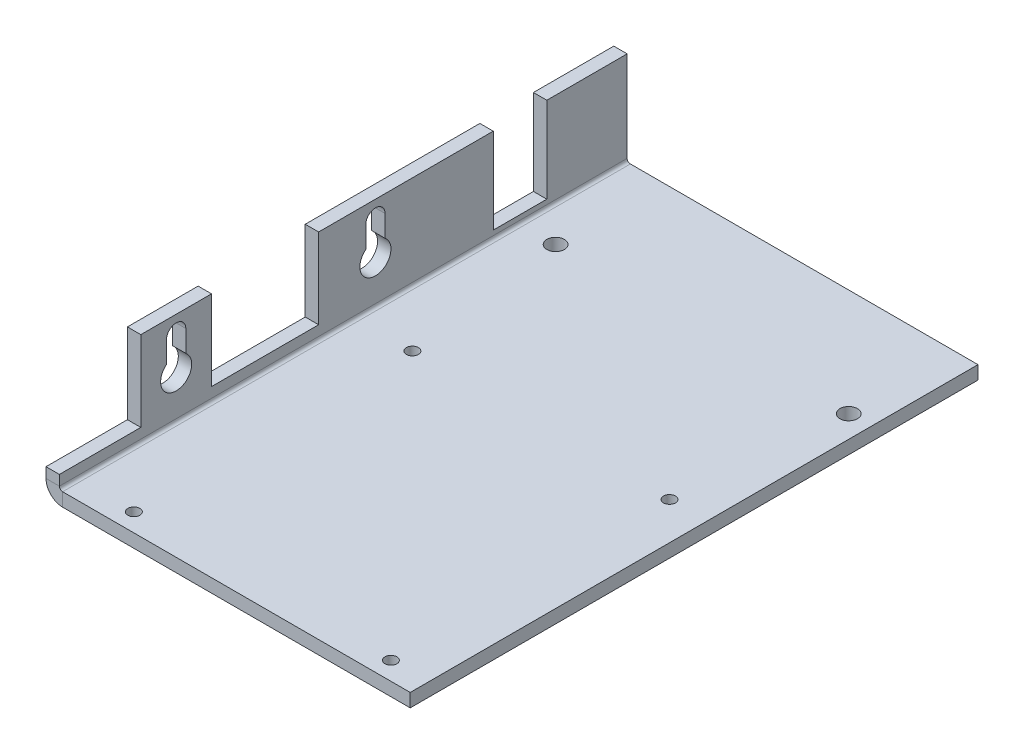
ISO-10303-21;
HEADER;
FILE_DESCRIPTION(('STEP AP214'),'2;1');
FILE_NAME('part.step','',(''),(''),'','','');
FILE_SCHEMA(('AUTOMOTIVE_DESIGN { 1 0 10303 214 1 1 1 1 }'));
ENDSEC;
DATA;
#1=APPLICATION_CONTEXT('core data for automotive mechanical design processes');
#2=APPLICATION_PROTOCOL_DEFINITION('international standard','automotive_design',2000,#1);
#3=PRODUCT_CONTEXT('',#1,'mechanical');
#4=PRODUCT('Part','Part','',(#3));
#5=PRODUCT_RELATED_PRODUCT_CATEGORY('part','',(#4));
#6=PRODUCT_DEFINITION_FORMATION('','',#4);
#7=PRODUCT_DEFINITION_CONTEXT('part definition',#1,'design');
#8=PRODUCT_DEFINITION('design','',#6,#7);
#9=PRODUCT_DEFINITION_SHAPE('','',#8);
#10=(LENGTH_UNIT() NAMED_UNIT(*) SI_UNIT(.MILLI.,.METRE.));
#11=(NAMED_UNIT(*) PLANE_ANGLE_UNIT() SI_UNIT($,.RADIAN.));
#12=(NAMED_UNIT(*) SI_UNIT($,.STERADIAN.) SOLID_ANGLE_UNIT());
#13=UNCERTAINTY_MEASURE_WITH_UNIT(LENGTH_MEASURE(1.E-05),#10,'distance_accuracy_value','');
#14=(GEOMETRIC_REPRESENTATION_CONTEXT(3) GLOBAL_UNCERTAINTY_ASSIGNED_CONTEXT((#13)) GLOBAL_UNIT_ASSIGNED_CONTEXT((#10,
#11,#12)) REPRESENTATION_CONTEXT('',''));
#15=CARTESIAN_POINT('',(0.,0.,0.));
#16=DIRECTION('',(0.,0.,1.));
#17=DIRECTION('',(1.,0.,0.));
#18=AXIS2_PLACEMENT_3D('',#15,#16,#17);
#19=CARTESIAN_POINT('',(-43.18,21.336,-29.972));
#20=DIRECTION('',(0.,0.,-1.));
#21=DIRECTION('',(-1.,0.,0.));
#22=AXIS2_PLACEMENT_3D('',#19,#20,#21);
#23=PLANE('',#22);
#24=DIRECTION('',(0.,1.,0.));
#25=VECTOR('',#24,1.);
#26=CARTESIAN_POINT('',(-40.005,21.336,-29.972));
#27=LINE('',#26,#25);
#28=CARTESIAN_POINT('',(-40.005,16.2226795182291,-29.972));
#29=VERTEX_POINT('',#28);
#30=CARTESIAN_POINT('',(-40.005,21.336,-29.972));
#31=VERTEX_POINT('',#30);
#32=EDGE_CURVE('E340',#29,#31,#27,.T.);
#33=ORIENTED_EDGE('',*,*,#32,.T.);
#34=DIRECTION('',(1.,0.,0.));
#35=VECTOR('',#34,1.);
#36=CARTESIAN_POINT('',(-43.18,21.336,-29.972));
#37=LINE('',#36,#35);
#38=CARTESIAN_POINT('',(-43.18,21.336,-29.972));
#39=VERTEX_POINT('',#38);
#40=EDGE_CURVE('E405',#39,#31,#37,.T.);
#41=ORIENTED_EDGE('',*,*,#40,.F.);
#42=DIRECTION('',(0.,1.,0.));
#43=VECTOR('',#42,1.);
#44=CARTESIAN_POINT('',(-43.18,21.336,-29.972));
#45=LINE('',#44,#43);
#46=CARTESIAN_POINT('',(-43.18,16.2226795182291,-29.972));
#47=VERTEX_POINT('',#46);
#48=EDGE_CURVE('E399',#47,#39,#45,.T.);
#49=ORIENTED_EDGE('',*,*,#48,.F.);
#50=DIRECTION('',(1.,0.,0.));
#51=VECTOR('',#50,1.);
#52=CARTESIAN_POINT('',(-43.18,16.2226795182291,-29.972));
#53=LINE('',#52,#51);
#54=EDGE_CURVE('E411',#47,#29,#53,.T.);
#55=ORIENTED_EDGE('',*,*,#54,.T.);
#56=EDGE_LOOP('',(#33,#41,#49,#55));
#57=FACE_BOUND('',#56,.T.);
#58=ADVANCED_FACE('F32',(#57),#23,.F.);
#59=CARTESIAN_POINT('',(-43.18,13.335,-27.6860000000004));
#60=DIRECTION('',(1.,0.,0.));
#61=DIRECTION('',(0.,0.,-1.));
#62=AXIS2_PLACEMENT_3D('',#59,#60,#61);
#63=CYLINDRICAL_SURFACE('',#62,3.683);
#64=CARTESIAN_POINT('',(-40.005,13.335,-27.6860000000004));
#65=DIRECTION('',(1.,0.,0.));
#66=DIRECTION('',(0.,0.,-1.));
#67=AXIS2_PLACEMENT_3D('',#64,#65,#66);
#68=CIRCLE('',#67,3.683);
#69=CARTESIAN_POINT('',(-40.005,16.2226795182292,-25.4));
#70=VERTEX_POINT('',#69);
#71=EDGE_CURVE('E343',#70,#29,#68,.T.);
#72=ORIENTED_EDGE('',*,*,#71,.T.);
#73=ORIENTED_EDGE('',*,*,#54,.F.);
#74=CARTESIAN_POINT('',(-43.18,13.335,-27.6860000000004));
#75=DIRECTION('',(1.,0.,0.));
#76=DIRECTION('',(0.,0.,-1.));
#77=AXIS2_PLACEMENT_3D('',#74,#75,#76);
#78=CIRCLE('',#77,3.683);
#79=CARTESIAN_POINT('',(-43.18,16.2226795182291,-25.4));
#80=VERTEX_POINT('',#79);
#81=EDGE_CURVE('E397',#80,#47,#78,.T.);
#82=ORIENTED_EDGE('',*,*,#81,.F.);
#83=DIRECTION('',(1.,0.,0.));
#84=VECTOR('',#83,1.);
#85=CARTESIAN_POINT('',(-43.18,16.2226795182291,-25.4));
#86=LINE('',#85,#84);
#87=EDGE_CURVE('E408',#80,#70,#86,.T.);
#88=ORIENTED_EDGE('',*,*,#87,.T.);
#89=EDGE_LOOP('',(#72,#73,#82,#88));
#90=FACE_BOUND('',#89,.T.);
#91=ADVANCED_FACE('F567',(#90),#63,.F.);
#92=CARTESIAN_POINT('',(-43.18,21.336,-25.4));
#93=DIRECTION('',(0.,0.,1.));
#94=DIRECTION('',(0.,-1.,0.));
#95=AXIS2_PLACEMENT_3D('',#92,#93,#94);
#96=PLANE('',#95);
#97=DIRECTION('',(0.,-1.,0.));
#98=VECTOR('',#97,1.);
#99=CARTESIAN_POINT('',(-40.005,21.336,-25.4));
#100=LINE('',#99,#98);
#101=CARTESIAN_POINT('',(-40.005,21.336,-25.4));
#102=VERTEX_POINT('',#101);
#103=EDGE_CURVE('E335',#102,#70,#100,.T.);
#104=ORIENTED_EDGE('',*,*,#103,.T.);
#105=ORIENTED_EDGE('',*,*,#87,.F.);
#106=DIRECTION('',(0.,-1.,0.));
#107=VECTOR('',#106,1.);
#108=CARTESIAN_POINT('',(-43.18,21.336,-25.4));
#109=LINE('',#108,#107);
#110=CARTESIAN_POINT('',(-43.18,21.336,-25.4));
#111=VERTEX_POINT('',#110);
#112=EDGE_CURVE('E395',#111,#80,#109,.T.);
#113=ORIENTED_EDGE('',*,*,#112,.F.);
#114=DIRECTION('',(1.,0.,0.));
#115=VECTOR('',#114,1.);
#116=CARTESIAN_POINT('',(-43.18,21.336,-25.4));
#117=LINE('',#116,#115);
#118=EDGE_CURVE('E402',#111,#102,#117,.T.);
#119=ORIENTED_EDGE('',*,*,#118,.T.);
#120=EDGE_LOOP('',(#104,#105,#113,#119));
#121=FACE_BOUND('',#120,.T.);
#122=ADVANCED_FACE('F563',(#121),#96,.F.);
#123=CARTESIAN_POINT('',(-43.18,21.336,-27.686));
#124=DIRECTION('',(1.,0.,0.));
#125=DIRECTION('',(0.,0.,-1.));
#126=AXIS2_PLACEMENT_3D('',#123,#124,#125);
#127=CYLINDRICAL_SURFACE('',#126,2.286);
#128=CARTESIAN_POINT('',(-40.005,21.336,-27.686));
#129=DIRECTION('',(1.,0.,0.));
#130=DIRECTION('',(0.,0.,-1.));
#131=AXIS2_PLACEMENT_3D('',#128,#129,#130);
#132=CIRCLE('',#131,2.286);
#133=EDGE_CURVE('E337',#31,#102,#132,.T.);
#134=ORIENTED_EDGE('',*,*,#133,.T.);
#135=ORIENTED_EDGE('',*,*,#118,.F.);
#136=CARTESIAN_POINT('',(-43.18,21.336,-27.686));
#137=DIRECTION('',(1.,0.,0.));
#138=DIRECTION('',(0.,0.,-1.));
#139=AXIS2_PLACEMENT_3D('',#136,#137,#138);
#140=CIRCLE('',#139,2.286);
#141=EDGE_CURVE('E393',#39,#111,#140,.T.);
#142=ORIENTED_EDGE('',*,*,#141,.F.);
#143=ORIENTED_EDGE('',*,*,#40,.T.);
#144=EDGE_LOOP('',(#134,#135,#142,#143));
#145=FACE_BOUND('',#144,.T.);
#146=ADVANCED_FACE('F560',(#145),#127,.F.);
#147=CARTESIAN_POINT('',(-43.18,0.,-134.62));
#148=DIRECTION('',(-1.,0.,0.));
#149=DIRECTION('',(0.,0.,1.));
#150=AXIS2_PLACEMENT_3D('',#147,#148,#149);
#151=PLANE('',#150);
#152=DIRECTION('',(0.,0.,-1.));
#153=VECTOR('',#152,1.);
#154=CARTESIAN_POINT('',(-43.18,3.937,-134.62));
#155=LINE('',#154,#153);
#156=CARTESIAN_POINT('',(-43.18,3.937,0.));
#157=VERTEX_POINT('',#156);
#158=CARTESIAN_POINT('',(-43.18,3.93699999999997,-134.62));
#159=VERTEX_POINT('',#158);
#160=EDGE_CURVE('E416',#157,#159,#155,.T.);
#161=ORIENTED_EDGE('',*,*,#160,.F.);
#162=DIRECTION('',(0.,-1.,0.));
#163=VECTOR('',#162,1.);
#164=CARTESIAN_POINT('',(-43.18,0.,0.));
#165=LINE('',#164,#163);
#166=CARTESIAN_POINT('',(-43.18,6.35000000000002,0.));
#167=VERTEX_POINT('',#166);
#168=EDGE_CURVE('E388',#167,#157,#165,.T.);
#169=ORIENTED_EDGE('',*,*,#168,.F.);
#170=DIRECTION('',(0.,0.,1.));
#171=VECTOR('',#170,1.);
#172=CARTESIAN_POINT('',(-43.18,6.35000000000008,-19.304));
#173=LINE('',#172,#171);
#174=CARTESIAN_POINT('',(-43.18,6.35000000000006,-19.304));
#175=VERTEX_POINT('',#174);
#176=EDGE_CURVE('E390',#175,#167,#173,.T.);
#177=ORIENTED_EDGE('',*,*,#176,.F.);
#178=DIRECTION('',(0.,-1.,0.));
#179=VECTOR('',#178,1.);
#180=CARTESIAN_POINT('',(-43.18,44.4499999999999,-19.3040000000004));
#181=LINE('',#180,#179);
#182=CARTESIAN_POINT('',(-43.18,25.4,-19.304));
#183=VERTEX_POINT('',#182);
#184=EDGE_CURVE('E370',#183,#175,#181,.T.);
#185=ORIENTED_EDGE('',*,*,#184,.F.);
#186=DIRECTION('',(0.,0.,1.));
#187=VECTOR('',#186,1.);
#188=CARTESIAN_POINT('',(-43.18,25.4,-134.62));
#189=LINE('',#188,#187);
#190=CARTESIAN_POINT('',(-43.18,25.4,-36.068));
#191=VERTEX_POINT('',#190);
#192=EDGE_CURVE('E372',#191,#183,#189,.T.);
#193=ORIENTED_EDGE('',*,*,#192,.F.);
#194=DIRECTION('',(0.,1.,0.));
#195=VECTOR('',#194,1.);
#196=CARTESIAN_POINT('',(-43.18,44.4499999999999,-36.0680000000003));
#197=LINE('',#196,#195);
#198=CARTESIAN_POINT('',(-43.18,6.34999999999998,-36.068));
#199=VERTEX_POINT('',#198);
#200=EDGE_CURVE('E374',#199,#191,#197,.T.);
#201=ORIENTED_EDGE('',*,*,#200,.F.);
#202=DIRECTION('',(0.,0.,1.));
#203=VECTOR('',#202,1.);
#204=CARTESIAN_POINT('',(-43.18,6.34999999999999,-61.468));
#205=LINE('',#204,#203);
#206=CARTESIAN_POINT('',(-43.18,6.34999999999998,-61.468));
#207=VERTEX_POINT('',#206);
#208=EDGE_CURVE('E377',#207,#199,#205,.T.);
#209=ORIENTED_EDGE('',*,*,#208,.F.);
#210=DIRECTION('',(0.,-1.,0.));
#211=VECTOR('',#210,1.);
#212=CARTESIAN_POINT('',(-43.18,44.45,-61.4680000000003));
#213=LINE('',#212,#211);
#214=CARTESIAN_POINT('',(-43.18,25.4,-61.468));
#215=VERTEX_POINT('',#214);
#216=EDGE_CURVE('E379',#215,#207,#213,.T.);
#217=ORIENTED_EDGE('',*,*,#216,.F.);
#218=CARTESIAN_POINT('',(-43.18,25.4,-102.87));
#219=VERTEX_POINT('',#218);
#220=EDGE_CURVE('E375',#219,#215,#189,.T.);
#221=ORIENTED_EDGE('',*,*,#220,.F.);
#222=DIRECTION('',(0.,1.,0.));
#223=VECTOR('',#222,1.);
#224=CARTESIAN_POINT('',(-43.18,45.72,-102.87));
#225=LINE('',#224,#223);
#226=CARTESIAN_POINT('',(-43.18,5.07999999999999,-102.87));
#227=VERTEX_POINT('',#226);
#228=EDGE_CURVE('E381',#227,#219,#225,.T.);
#229=ORIENTED_EDGE('',*,*,#228,.F.);
#230=DIRECTION('',(0.,0.,1.));
#231=VECTOR('',#230,1.);
#232=CARTESIAN_POINT('',(-43.18,5.08000000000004,-115.57));
#233=LINE('',#232,#231);
#234=CARTESIAN_POINT('',(-43.18,5.08000000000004,-115.57));
#235=VERTEX_POINT('',#234);
#236=EDGE_CURVE('E383',#235,#227,#233,.T.);
#237=ORIENTED_EDGE('',*,*,#236,.F.);
#238=DIRECTION('',(0.,-1.,0.));
#239=VECTOR('',#238,1.);
#240=CARTESIAN_POINT('',(-43.18,45.72,-115.57));
#241=LINE('',#240,#239);
#242=CARTESIAN_POINT('',(-43.18,25.4,-115.57));
#243=VERTEX_POINT('',#242);
#244=EDGE_CURVE('E385',#243,#235,#241,.T.);
#245=ORIENTED_EDGE('',*,*,#244,.F.);
#246=CARTESIAN_POINT('',(-43.18,25.4,-134.62));
#247=VERTEX_POINT('',#246);
#248=EDGE_CURVE('E53',#247,#243,#189,.T.);
#249=ORIENTED_EDGE('',*,*,#248,.F.);
#250=DIRECTION('',(0.,-1.,0.));
#251=VECTOR('',#250,1.);
#252=CARTESIAN_POINT('',(-43.18,0.,-134.62));
#253=LINE('',#252,#251);
#254=EDGE_CURVE('E46',#247,#159,#253,.T.);
#255=ORIENTED_EDGE('',*,*,#254,.T.);
#256=EDGE_LOOP('',(#161,#169,#177,#185,#193,#201,#209,#217,#221,#229,#237,#245,#249,#255));
#257=FACE_BOUND('',#256,.T.);
#258=CARTESIAN_POINT('',(-43.18,13.335,-74.9300000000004));
#259=DIRECTION('',(1.,0.,0.));
#260=DIRECTION('',(0.,0.,1.));
#261=AXIS2_PLACEMENT_3D('',#258,#259,#260);
#262=CIRCLE('',#261,3.683);
#263=CARTESIAN_POINT('',(-43.18,16.2226795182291,-72.6439999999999));
#264=VERTEX_POINT('',#263);
#265=CARTESIAN_POINT('',(-43.18,16.2226795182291,-77.216));
#266=VERTEX_POINT('',#265);
#267=EDGE_CURVE('E367',#264,#266,#262,.T.);
#268=ORIENTED_EDGE('',*,*,#267,.T.);
#269=DIRECTION('',(0.,1.,0.));
#270=VECTOR('',#269,1.);
#271=CARTESIAN_POINT('',(-43.18,21.336,-77.216));
#272=LINE('',#271,#270);
#273=CARTESIAN_POINT('',(-43.18,21.336,-77.216));
#274=VERTEX_POINT('',#273);
#275=EDGE_CURVE('E349',#266,#274,#272,.T.);
#276=ORIENTED_EDGE('',*,*,#275,.T.);
#277=CARTESIAN_POINT('',(-43.18,21.336,-74.9299999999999));
#278=DIRECTION('',(1.,0.,0.));
#279=DIRECTION('',(0.,0.,1.));
#280=AXIS2_PLACEMENT_3D('',#277,#278,#279);
#281=CIRCLE('',#280,2.286);
#282=CARTESIAN_POINT('',(-43.18,21.336,-72.644));
#283=VERTEX_POINT('',#282);
#284=EDGE_CURVE('E358',#274,#283,#281,.T.);
#285=ORIENTED_EDGE('',*,*,#284,.T.);
#286=DIRECTION('',(0.,-1.,0.));
#287=VECTOR('',#286,1.);
#288=CARTESIAN_POINT('',(-43.18,21.336,-72.644));
#289=LINE('',#288,#287);
#290=EDGE_CURVE('E364',#283,#264,#289,.T.);
#291=ORIENTED_EDGE('',*,*,#290,.T.);
#292=EDGE_LOOP('',(#268,#276,#285,#291));
#293=FACE_BOUND('',#292,.T.);
#294=ORIENTED_EDGE('',*,*,#141,.T.);
#295=ORIENTED_EDGE('',*,*,#112,.T.);
#296=ORIENTED_EDGE('',*,*,#81,.T.);
#297=ORIENTED_EDGE('',*,*,#48,.T.);
#298=EDGE_LOOP('',(#294,#295,#296,#297));
#299=FACE_BOUND('',#298,.T.);
#300=ADVANCED_FACE('F457',(#257,#293,#299),#151,.T.);
#301=CARTESIAN_POINT('',(-43.18,13.335,-74.9300000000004));
#302=DIRECTION('',(1.,0.,0.));
#303=DIRECTION('',(0.,0.,-1.));
#304=AXIS2_PLACEMENT_3D('',#301,#302,#303);
#305=CYLINDRICAL_SURFACE('',#304,3.683);
#306=CARTESIAN_POINT('',(-40.005,13.335,-74.9300000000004));
#307=DIRECTION('',(1.,0.,0.));
#308=DIRECTION('',(0.,0.,1.));
#309=AXIS2_PLACEMENT_3D('',#306,#307,#308);
#310=CIRCLE('',#309,3.683);
#311=CARTESIAN_POINT('',(-40.005,16.2226795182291,-72.6439999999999));
#312=VERTEX_POINT('',#311);
#313=CARTESIAN_POINT('',(-40.005,16.2226795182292,-77.216));
#314=VERTEX_POINT('',#313);
#315=EDGE_CURVE('E326',#312,#314,#310,.T.);
#316=ORIENTED_EDGE('',*,*,#315,.T.);
#317=DIRECTION('',(1.,0.,0.));
#318=VECTOR('',#317,1.);
#319=CARTESIAN_POINT('',(-43.18,16.2226795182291,-77.216));
#320=LINE('',#319,#318);
#321=EDGE_CURVE('E352',#266,#314,#320,.T.);
#322=ORIENTED_EDGE('',*,*,#321,.F.);
#323=ORIENTED_EDGE('',*,*,#267,.F.);
#324=DIRECTION('',(1.,0.,0.));
#325=VECTOR('',#324,1.);
#326=CARTESIAN_POINT('',(-43.18,16.2226795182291,-72.6439999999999));
#327=LINE('',#326,#325);
#328=EDGE_CURVE('E361',#264,#312,#327,.T.);
#329=ORIENTED_EDGE('',*,*,#328,.T.);
#330=EDGE_LOOP('',(#316,#322,#323,#329));
#331=FACE_BOUND('',#330,.T.);
#332=ADVANCED_FACE('F553',(#331),#305,.F.);
#333=CARTESIAN_POINT('',(-43.18,21.336,-72.644));
#334=DIRECTION('',(0.,0.,1.));
#335=DIRECTION('',(1.,0.,0.));
#336=AXIS2_PLACEMENT_3D('',#333,#334,#335);
#337=PLANE('',#336);
#338=DIRECTION('',(0.,-1.,0.));
#339=VECTOR('',#338,1.);
#340=CARTESIAN_POINT('',(-40.005,21.336,-72.644));
#341=LINE('',#340,#339);
#342=CARTESIAN_POINT('',(-40.005,21.336,-72.644));
#343=VERTEX_POINT('',#342);
#344=EDGE_CURVE('E329',#343,#312,#341,.T.);
#345=ORIENTED_EDGE('',*,*,#344,.T.);
#346=ORIENTED_EDGE('',*,*,#328,.F.);
#347=ORIENTED_EDGE('',*,*,#290,.F.);
#348=DIRECTION('',(1.,0.,0.));
#349=VECTOR('',#348,1.);
#350=CARTESIAN_POINT('',(-43.18,21.336,-72.644));
#351=LINE('',#350,#349);
#352=EDGE_CURVE('E355',#283,#343,#351,.T.);
#353=ORIENTED_EDGE('',*,*,#352,.T.);
#354=EDGE_LOOP('',(#345,#346,#347,#353));
#355=FACE_BOUND('',#354,.T.);
#356=ADVANCED_FACE('F549',(#355),#337,.F.);
#357=CARTESIAN_POINT('',(-43.18,21.336,-74.9299999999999));
#358=DIRECTION('',(1.,0.,0.));
#359=DIRECTION('',(0.,0.,-1.));
#360=AXIS2_PLACEMENT_3D('',#357,#358,#359);
#361=CYLINDRICAL_SURFACE('',#360,2.286);
#362=CARTESIAN_POINT('',(-40.005,21.336,-74.9299999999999));
#363=DIRECTION('',(1.,0.,0.));
#364=DIRECTION('',(0.,0.,1.));
#365=AXIS2_PLACEMENT_3D('',#362,#363,#364);
#366=CIRCLE('',#365,2.286);
#367=CARTESIAN_POINT('',(-40.005,21.3360000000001,-77.216));
#368=VERTEX_POINT('',#367);
#369=EDGE_CURVE('E332',#368,#343,#366,.T.);
#370=ORIENTED_EDGE('',*,*,#369,.T.);
#371=ORIENTED_EDGE('',*,*,#352,.F.);
#372=ORIENTED_EDGE('',*,*,#284,.F.);
#373=DIRECTION('',(1.,0.,0.));
#374=VECTOR('',#373,1.);
#375=CARTESIAN_POINT('',(-43.18,21.336,-77.216));
#376=LINE('',#375,#374);
#377=EDGE_CURVE('E346',#274,#368,#376,.T.);
#378=ORIENTED_EDGE('',*,*,#377,.T.);
#379=EDGE_LOOP('',(#370,#371,#372,#378));
#380=FACE_BOUND('',#379,.T.);
#381=ADVANCED_FACE('F541',(#380),#361,.F.);
#382=CARTESIAN_POINT('',(-43.18,21.336,-77.216));
#383=DIRECTION('',(0.,0.,-1.));
#384=DIRECTION('',(0.,1.,0.));
#385=AXIS2_PLACEMENT_3D('',#382,#383,#384);
#386=PLANE('',#385);
#387=DIRECTION('',(0.,1.,0.));
#388=VECTOR('',#387,1.);
#389=CARTESIAN_POINT('',(-40.005,21.3360000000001,-77.216));
#390=LINE('',#389,#388);
#391=EDGE_CURVE('E324',#314,#368,#390,.T.);
#392=ORIENTED_EDGE('',*,*,#391,.T.);
#393=ORIENTED_EDGE('',*,*,#377,.F.);
#394=ORIENTED_EDGE('',*,*,#275,.F.);
#395=ORIENTED_EDGE('',*,*,#321,.T.);
#396=EDGE_LOOP('',(#392,#393,#394,#395));
#397=FACE_BOUND('',#396,.T.);
#398=ADVANCED_FACE('F535',(#397),#386,.F.);
#399=CARTESIAN_POINT('',(-40.005,0.,-134.62));
#400=DIRECTION('',(-1.,0.,0.));
#401=DIRECTION('',(0.,0.,1.));
#402=AXIS2_PLACEMENT_3D('',#399,#400,#401);
#403=PLANE('',#402);
#404=DIRECTION('',(0.,1.,0.));
#405=VECTOR('',#404,1.);
#406=CARTESIAN_POINT('',(-40.005,0.,0.));
#407=LINE('',#406,#405);
#408=CARTESIAN_POINT('',(-40.005,6.35000000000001,0.));
#409=VERTEX_POINT('',#408);
#410=CARTESIAN_POINT('',(-40.005,3.937,0.));
#411=VERTEX_POINT('',#410);
#412=EDGE_CURVE('E307',#409,#411,#407,.F.);
#413=ORIENTED_EDGE('',*,*,#412,.T.);
#414=DIRECTION('',(0.,0.,-1.));
#415=VECTOR('',#414,1.);
#416=CARTESIAN_POINT('',(-40.005,3.93700000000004,-134.62));
#417=LINE('',#416,#415);
#418=CARTESIAN_POINT('',(-40.005,3.93700000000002,-134.62));
#419=VERTEX_POINT('',#418);
#420=EDGE_CURVE('E414',#411,#419,#417,.T.);
#421=ORIENTED_EDGE('',*,*,#420,.T.);
#422=DIRECTION('',(0.,1.,0.));
#423=VECTOR('',#422,1.);
#424=CARTESIAN_POINT('',(-40.005,0.,-134.62));
#425=LINE('',#424,#423);
#426=CARTESIAN_POINT('',(-40.005,25.4,-134.62));
#427=VERTEX_POINT('',#426);
#428=EDGE_CURVE('E309',#427,#419,#425,.F.);
#429=ORIENTED_EDGE('',*,*,#428,.F.);
#430=DIRECTION('',(0.,0.,1.));
#431=VECTOR('',#430,1.);
#432=CARTESIAN_POINT('',(-40.005,25.4,-134.62));
#433=LINE('',#432,#431);
#434=CARTESIAN_POINT('',(-40.005,25.4,-115.57));
#435=VERTEX_POINT('',#434);
#436=EDGE_CURVE('E247',#427,#435,#433,.T.);
#437=ORIENTED_EDGE('',*,*,#436,.T.);
#438=DIRECTION('',(0.,-1.,0.));
#439=VECTOR('',#438,1.);
#440=CARTESIAN_POINT('',(-40.005,0.,-115.57));
#441=LINE('',#440,#439);
#442=CARTESIAN_POINT('',(-40.005,5.08,-115.57));
#443=VERTEX_POINT('',#442);
#444=EDGE_CURVE('E312',#435,#443,#441,.T.);
#445=ORIENTED_EDGE('',*,*,#444,.T.);
#446=DIRECTION('',(0.,0.,1.));
#447=VECTOR('',#446,1.);
#448=CARTESIAN_POINT('',(-40.005,5.08000000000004,-134.62));
#449=LINE('',#448,#447);
#450=CARTESIAN_POINT('',(-40.005,5.08,-102.87));
#451=VERTEX_POINT('',#450);
#452=EDGE_CURVE('E314',#443,#451,#449,.T.);
#453=ORIENTED_EDGE('',*,*,#452,.T.);
#454=DIRECTION('',(0.,1.,0.));
#455=VECTOR('',#454,1.);
#456=CARTESIAN_POINT('',(-40.005,0.,-102.87));
#457=LINE('',#456,#455);
#458=CARTESIAN_POINT('',(-40.005,25.4,-102.87));
#459=VERTEX_POINT('',#458);
#460=EDGE_CURVE('E316',#451,#459,#457,.T.);
#461=ORIENTED_EDGE('',*,*,#460,.T.);
#462=CARTESIAN_POINT('',(-40.005,25.4,-61.468));
#463=VERTEX_POINT('',#462);
#464=EDGE_CURVE('E246',#459,#463,#433,.T.);
#465=ORIENTED_EDGE('',*,*,#464,.T.);
#466=DIRECTION('',(0.,-1.,0.));
#467=VECTOR('',#466,1.);
#468=CARTESIAN_POINT('',(-40.005,0.,-61.468));
#469=LINE('',#468,#467);
#470=CARTESIAN_POINT('',(-40.005,6.35000000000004,-61.468));
#471=VERTEX_POINT('',#470);
#472=EDGE_CURVE('E318',#463,#471,#469,.T.);
#473=ORIENTED_EDGE('',*,*,#472,.T.);
#474=DIRECTION('',(0.,0.,1.));
#475=VECTOR('',#474,1.);
#476=CARTESIAN_POINT('',(-40.005,6.35000000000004,-134.62));
#477=LINE('',#476,#475);
#478=CARTESIAN_POINT('',(-40.005,6.34999999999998,-36.068));
#479=VERTEX_POINT('',#478);
#480=EDGE_CURVE('E320',#471,#479,#477,.T.);
#481=ORIENTED_EDGE('',*,*,#480,.T.);
#482=DIRECTION('',(0.,1.,0.));
#483=VECTOR('',#482,1.);
#484=CARTESIAN_POINT('',(-40.005,0.,-36.068));
#485=LINE('',#484,#483);
#486=CARTESIAN_POINT('',(-40.005,25.4,-36.068));
#487=VERTEX_POINT('',#486);
#488=EDGE_CURVE('E322',#479,#487,#485,.T.);
#489=ORIENTED_EDGE('',*,*,#488,.T.);
#490=CARTESIAN_POINT('',(-40.005,25.4,-19.304));
#491=VERTEX_POINT('',#490);
#492=EDGE_CURVE('E241',#487,#491,#433,.T.);
#493=ORIENTED_EDGE('',*,*,#492,.T.);
#494=DIRECTION('',(0.,-1.,0.));
#495=VECTOR('',#494,1.);
#496=CARTESIAN_POINT('',(-40.005,0.,-19.304));
#497=LINE('',#496,#495);
#498=CARTESIAN_POINT('',(-40.005,6.35000000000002,-19.304));
#499=VERTEX_POINT('',#498);
#500=EDGE_CURVE('E244',#491,#499,#497,.T.);
#501=ORIENTED_EDGE('',*,*,#500,.T.);
#502=DIRECTION('',(0.,0.,1.));
#503=VECTOR('',#502,1.);
#504=CARTESIAN_POINT('',(-40.005,6.35000000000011,-134.62));
#505=LINE('',#504,#503);
#506=EDGE_CURVE('E305',#499,#409,#505,.T.);
#507=ORIENTED_EDGE('',*,*,#506,.T.);
#508=EDGE_LOOP('',(#413,#421,#429,#437,#445,#453,#461,#465,#473,#481,#489,#493,#501,#507));
#509=FACE_BOUND('',#508,.T.);
#510=ORIENTED_EDGE('',*,*,#391,.F.);
#511=ORIENTED_EDGE('',*,*,#315,.F.);
#512=ORIENTED_EDGE('',*,*,#344,.F.);
#513=ORIENTED_EDGE('',*,*,#369,.F.);
#514=EDGE_LOOP('',(#510,#511,#512,#513));
#515=FACE_BOUND('',#514,.T.);
#516=ORIENTED_EDGE('',*,*,#103,.F.);
#517=ORIENTED_EDGE('',*,*,#133,.F.);
#518=ORIENTED_EDGE('',*,*,#32,.F.);
#519=ORIENTED_EDGE('',*,*,#71,.F.);
#520=EDGE_LOOP('',(#516,#517,#518,#519));
#521=FACE_BOUND('',#520,.T.);
#522=ADVANCED_FACE('F485',(#509,#515,#521),#403,.F.);
#523=CARTESIAN_POINT('',(232.635457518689,0.,-134.62));
#524=DIRECTION('',(0.,0.,-1.));
#525=DIRECTION('',(0.,1.,0.));
#526=AXIS2_PLACEMENT_3D('',#523,#524,#525);
#527=PLANE('',#526);
#528=DIRECTION('',(-1.,0.,0.));
#529=VECTOR('',#528,1.);
#530=CARTESIAN_POINT('',(232.635457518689,3.937,-134.62));
#531=LINE('',#530,#529);
#532=EDGE_CURVE('E11',#419,#159,#531,.T.);
#533=ORIENTED_EDGE('',*,*,#532,.T.);
#534=ORIENTED_EDGE('',*,*,#254,.F.);
#535=DIRECTION('',(-1.,0.,0.));
#536=VECTOR('',#535,1.);
#537=CARTESIAN_POINT('',(232.635457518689,25.4,-134.62));
#538=LINE('',#537,#536);
#539=EDGE_CURVE('E40',#427,#247,#538,.T.);
#540=ORIENTED_EDGE('',*,*,#539,.F.);
#541=ORIENTED_EDGE('',*,*,#428,.T.);
#542=EDGE_LOOP('',(#533,#534,#540,#541));
#543=FACE_BOUND('',#542,.T.);
#544=ADVANCED_FACE('F34',(#543),#527,.T.);
#545=CARTESIAN_POINT('',(232.635457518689,25.4,-134.62));
#546=DIRECTION('',(0.,-1.,0.));
#547=DIRECTION('',(1.,0.,0.));
#548=AXIS2_PLACEMENT_3D('',#545,#546,#547);
#549=PLANE('',#548);
#550=ORIENTED_EDGE('',*,*,#248,.T.);
#551=DIRECTION('',(-1.,0.,0.));
#552=VECTOR('',#551,1.);
#553=CARTESIAN_POINT('',(232.635457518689,25.4,-115.57));
#554=LINE('',#553,#552);
#555=EDGE_CURVE('E451',#435,#243,#554,.T.);
#556=ORIENTED_EDGE('',*,*,#555,.F.);
#557=ORIENTED_EDGE('',*,*,#436,.F.);
#558=ORIENTED_EDGE('',*,*,#539,.T.);
#559=EDGE_LOOP('',(#550,#556,#557,#558));
#560=FACE_BOUND('',#559,.T.);
#561=ADVANCED_FACE('F453',(#560),#549,.F.);
#562=CARTESIAN_POINT('',(232.635457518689,0.,-115.57));
#563=DIRECTION('',(0.,0.,-1.));
#564=DIRECTION('',(0.,1.,0.));
#565=AXIS2_PLACEMENT_3D('',#562,#563,#564);
#566=PLANE('',#565);
#567=ORIENTED_EDGE('',*,*,#244,.T.);
#568=DIRECTION('',(-1.,0.,0.));
#569=VECTOR('',#568,1.);
#570=CARTESIAN_POINT('',(232.635457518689,5.07999999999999,-115.57));
#571=LINE('',#570,#569);
#572=EDGE_CURVE('E448',#443,#235,#571,.T.);
#573=ORIENTED_EDGE('',*,*,#572,.F.);
#574=ORIENTED_EDGE('',*,*,#444,.F.);
#575=ORIENTED_EDGE('',*,*,#555,.T.);
#576=EDGE_LOOP('',(#567,#573,#574,#575));
#577=FACE_BOUND('',#576,.T.);
#578=ADVANCED_FACE('F581',(#577),#566,.F.);
#579=CARTESIAN_POINT('',(232.635457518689,5.08,-134.62));
#580=DIRECTION('',(0.,-1.,0.));
#581=DIRECTION('',(1.,0.,0.));
#582=AXIS2_PLACEMENT_3D('',#579,#580,#581);
#583=PLANE('',#582);
#584=ORIENTED_EDGE('',*,*,#236,.T.);
#585=DIRECTION('',(-1.,0.,0.));
#586=VECTOR('',#585,1.);
#587=CARTESIAN_POINT('',(232.635457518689,5.07999999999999,-102.87));
#588=LINE('',#587,#586);
#589=EDGE_CURVE('E445',#451,#227,#588,.T.);
#590=ORIENTED_EDGE('',*,*,#589,.F.);
#591=ORIENTED_EDGE('',*,*,#452,.F.);
#592=ORIENTED_EDGE('',*,*,#572,.T.);
#593=EDGE_LOOP('',(#584,#590,#591,#592));
#594=FACE_BOUND('',#593,.T.);
#595=ADVANCED_FACE('F591',(#594),#583,.F.);
#596=CARTESIAN_POINT('',(232.635457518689,0.,-102.87));
#597=DIRECTION('',(0.,0.,1.));
#598=DIRECTION('',(0.,-1.,0.));
#599=AXIS2_PLACEMENT_3D('',#596,#597,#598);
#600=PLANE('',#599);
#601=ORIENTED_EDGE('',*,*,#228,.T.);
#602=DIRECTION('',(-1.,0.,0.));
#603=VECTOR('',#602,1.);
#604=CARTESIAN_POINT('',(232.635457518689,25.4,-102.87));
#605=LINE('',#604,#603);
#606=EDGE_CURVE('E442',#459,#219,#605,.T.);
#607=ORIENTED_EDGE('',*,*,#606,.F.);
#608=ORIENTED_EDGE('',*,*,#460,.F.);
#609=ORIENTED_EDGE('',*,*,#589,.T.);
#610=EDGE_LOOP('',(#601,#607,#608,#609));
#611=FACE_BOUND('',#610,.T.);
#612=ADVANCED_FACE('F588',(#611),#600,.F.);
#613=ORIENTED_EDGE('',*,*,#220,.T.);
#614=DIRECTION('',(-1.,0.,0.));
#615=VECTOR('',#614,1.);
#616=CARTESIAN_POINT('',(232.635457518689,25.4,-61.468));
#617=LINE('',#616,#615);
#618=EDGE_CURVE('E439',#463,#215,#617,.T.);
#619=ORIENTED_EDGE('',*,*,#618,.F.);
#620=ORIENTED_EDGE('',*,*,#464,.F.);
#621=ORIENTED_EDGE('',*,*,#606,.T.);
#622=EDGE_LOOP('',(#613,#619,#620,#621));
#623=FACE_BOUND('',#622,.T.);
#624=ADVANCED_FACE('F463',(#623),#549,.F.);
#625=CARTESIAN_POINT('',(232.635457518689,0.,-61.468));
#626=DIRECTION('',(0.,0.,-1.));
#627=DIRECTION('',(0.,1.,0.));
#628=AXIS2_PLACEMENT_3D('',#625,#626,#627);
#629=PLANE('',#628);
#630=ORIENTED_EDGE('',*,*,#216,.T.);
#631=DIRECTION('',(-1.,0.,0.));
#632=VECTOR('',#631,1.);
#633=CARTESIAN_POINT('',(232.635457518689,6.35000000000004,-61.468));
#634=LINE('',#633,#632);
#635=EDGE_CURVE('E436',#471,#207,#634,.T.);
#636=ORIENTED_EDGE('',*,*,#635,.F.);
#637=ORIENTED_EDGE('',*,*,#472,.F.);
#638=ORIENTED_EDGE('',*,*,#618,.T.);
#639=EDGE_LOOP('',(#630,#636,#637,#638));
#640=FACE_BOUND('',#639,.T.);
#641=ADVANCED_FACE('F470',(#640),#629,.F.);
#642=CARTESIAN_POINT('',(232.635457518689,6.34999999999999,-134.62));
#643=DIRECTION('',(0.,-1.,0.));
#644=DIRECTION('',(1.,0.,0.));
#645=AXIS2_PLACEMENT_3D('',#642,#643,#644);
#646=PLANE('',#645);
#647=ORIENTED_EDGE('',*,*,#208,.T.);
#648=DIRECTION('',(-1.,0.,0.));
#649=VECTOR('',#648,1.);
#650=CARTESIAN_POINT('',(232.635457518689,6.34999999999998,-36.068));
#651=LINE('',#650,#649);
#652=EDGE_CURVE('E433',#479,#199,#651,.T.);
#653=ORIENTED_EDGE('',*,*,#652,.F.);
#654=ORIENTED_EDGE('',*,*,#480,.F.);
#655=ORIENTED_EDGE('',*,*,#635,.T.);
#656=EDGE_LOOP('',(#647,#653,#654,#655));
#657=FACE_BOUND('',#656,.T.);
#658=ADVANCED_FACE('F477',(#657),#646,.F.);
#659=CARTESIAN_POINT('',(232.635457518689,0.,-36.0679999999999));
#660=DIRECTION('',(0.,0.,1.));
#661=DIRECTION('',(0.,-1.,0.));
#662=AXIS2_PLACEMENT_3D('',#659,#660,#661);
#663=PLANE('',#662);
#664=ORIENTED_EDGE('',*,*,#200,.T.);
#665=DIRECTION('',(-1.,0.,0.));
#666=VECTOR('',#665,1.);
#667=CARTESIAN_POINT('',(232.635457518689,25.4,-36.0679999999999));
#668=LINE('',#667,#666);
#669=EDGE_CURVE('E430',#487,#191,#668,.T.);
#670=ORIENTED_EDGE('',*,*,#669,.F.);
#671=ORIENTED_EDGE('',*,*,#488,.F.);
#672=ORIENTED_EDGE('',*,*,#652,.T.);
#673=EDGE_LOOP('',(#664,#670,#671,#672));
#674=FACE_BOUND('',#673,.T.);
#675=ADVANCED_FACE('F481',(#674),#663,.F.);
#676=ORIENTED_EDGE('',*,*,#192,.T.);
#677=DIRECTION('',(-1.,0.,0.));
#678=VECTOR('',#677,1.);
#679=CARTESIAN_POINT('',(232.635457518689,25.4,-19.304));
#680=LINE('',#679,#678);
#681=EDGE_CURVE('E427',#491,#183,#680,.T.);
#682=ORIENTED_EDGE('',*,*,#681,.F.);
#683=ORIENTED_EDGE('',*,*,#492,.F.);
#684=ORIENTED_EDGE('',*,*,#669,.T.);
#685=EDGE_LOOP('',(#676,#682,#683,#684));
#686=FACE_BOUND('',#685,.T.);
#687=ADVANCED_FACE('F490',(#686),#549,.F.);
#688=CARTESIAN_POINT('',(232.635457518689,0.,-19.304));
#689=DIRECTION('',(0.,0.,-1.));
#690=DIRECTION('',(0.,1.,0.));
#691=AXIS2_PLACEMENT_3D('',#688,#689,#690);
#692=PLANE('',#691);
#693=ORIENTED_EDGE('',*,*,#184,.T.);
#694=DIRECTION('',(-1.,0.,0.));
#695=VECTOR('',#694,1.);
#696=CARTESIAN_POINT('',(232.635457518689,6.35000000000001,-19.304));
#697=LINE('',#696,#695);
#698=EDGE_CURVE('E424',#499,#175,#697,.T.);
#699=ORIENTED_EDGE('',*,*,#698,.F.);
#700=ORIENTED_EDGE('',*,*,#500,.F.);
#701=ORIENTED_EDGE('',*,*,#681,.T.);
#702=EDGE_LOOP('',(#693,#699,#700,#701));
#703=FACE_BOUND('',#702,.T.);
#704=ADVANCED_FACE('F493',(#703),#692,.F.);
#705=CARTESIAN_POINT('',(232.635457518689,6.35000000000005,-134.62));
#706=DIRECTION('',(0.,-1.,0.));
#707=DIRECTION('',(0.,0.,-1.));
#708=AXIS2_PLACEMENT_3D('',#705,#706,#707);
#709=PLANE('',#708);
#710=ORIENTED_EDGE('',*,*,#176,.T.);
#711=DIRECTION('',(-1.,0.,0.));
#712=VECTOR('',#711,1.);
#713=CARTESIAN_POINT('',(232.635457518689,6.35000000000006,0.));
#714=LINE('',#713,#712);
#715=EDGE_CURVE('E422',#409,#167,#714,.T.);
#716=ORIENTED_EDGE('',*,*,#715,.F.);
#717=ORIENTED_EDGE('',*,*,#506,.F.);
#718=ORIENTED_EDGE('',*,*,#698,.T.);
#719=EDGE_LOOP('',(#710,#716,#717,#718));
#720=FACE_BOUND('',#719,.T.);
#721=ADVANCED_FACE('F499',(#720),#709,.F.);
#722=CARTESIAN_POINT('',(232.635457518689,0.,0.));
#723=DIRECTION('',(0.,0.,-1.));
#724=DIRECTION('',(0.,1.,0.));
#725=AXIS2_PLACEMENT_3D('',#722,#723,#724);
#726=PLANE('',#725);
#727=ORIENTED_EDGE('',*,*,#168,.T.);
#728=DIRECTION('',(-1.,0.,0.));
#729=VECTOR('',#728,1.);
#730=CARTESIAN_POINT('',(232.635457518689,3.93700000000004,0.));
#731=LINE('',#730,#729);
#732=EDGE_CURVE('E419',#411,#157,#731,.T.);
#733=ORIENTED_EDGE('',*,*,#732,.F.);
#734=ORIENTED_EDGE('',*,*,#412,.F.);
#735=ORIENTED_EDGE('',*,*,#715,.T.);
#736=EDGE_LOOP('',(#727,#733,#734,#735));
#737=FACE_BOUND('',#736,.T.);
#738=ADVANCED_FACE('F504',(#737),#726,.F.);
#739=CARTESIAN_POINT('',(43.18,318.871660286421,-134.62));
#740=DIRECTION('',(1.,0.,0.));
#741=DIRECTION('',(0.,0.,-1.));
#742=AXIS2_PLACEMENT_3D('',#739,#740,#741);
#743=PLANE('',#742);
#744=DIRECTION('',(0.,-1.,0.));
#745=VECTOR('',#744,1.);
#746=CARTESIAN_POINT('',(43.18,318.871660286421,0.));
#747=LINE('',#746,#745);
#748=CARTESIAN_POINT('',(43.18,3.17500000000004,0.));
#749=VERTEX_POINT('',#748);
#750=CARTESIAN_POINT('',(43.18,0.,0.));
#751=VERTEX_POINT('',#750);
#752=EDGE_CURVE('E237',#749,#751,#747,.T.);
#753=ORIENTED_EDGE('',*,*,#752,.T.);
#754=DIRECTION('',(0.,0.,1.));
#755=VECTOR('',#754,1.);
#756=CARTESIAN_POINT('',(43.18,0.,-134.62));
#757=LINE('',#756,#755);
#758=CARTESIAN_POINT('',(43.18,0.,-134.62));
#759=VERTEX_POINT('',#758);
#760=EDGE_CURVE('E248',#759,#751,#757,.T.);
#761=ORIENTED_EDGE('',*,*,#760,.F.);
#762=DIRECTION('',(0.,-1.,0.));
#763=VECTOR('',#762,1.);
#764=CARTESIAN_POINT('',(43.18,318.871660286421,-134.62));
#765=LINE('',#764,#763);
#766=CARTESIAN_POINT('',(43.18,3.17500000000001,-134.62));
#767=VERTEX_POINT('',#766);
#768=EDGE_CURVE('E242',#767,#759,#765,.T.);
#769=ORIENTED_EDGE('',*,*,#768,.F.);
#770=DIRECTION('',(0.,0.,1.));
#771=VECTOR('',#770,1.);
#772=CARTESIAN_POINT('',(43.18,3.17500000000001,-134.62));
#773=LINE('',#772,#771);
#774=EDGE_CURVE('E240',#767,#749,#773,.T.);
#775=ORIENTED_EDGE('',*,*,#774,.T.);
#776=EDGE_LOOP('',(#753,#761,#769,#775));
#777=FACE_BOUND('',#776,.T.);
#778=ADVANCED_FACE('F521',(#777),#743,.T.);
#779=CARTESIAN_POINT('',(37.9222,3.17500000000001,-109.22));
#780=DIRECTION('',(0.,1.,0.));
#781=DIRECTION('',(0.,0.,1.));
#782=AXIS2_PLACEMENT_3D('',#779,#780,#781);
#783=CYLINDRICAL_SURFACE('',#782,2.0828);
#784=CARTESIAN_POINT('',(37.9222,0.,-109.22));
#785=DIRECTION('',(0.,-1.,0.));
#786=DIRECTION('',(0.,0.,-1.));
#787=AXIS2_PLACEMENT_3D('',#784,#785,#786);
#788=CIRCLE('',#787,2.0828);
#789=CARTESIAN_POINT('',(37.9222,0.,-111.3028));
#790=VERTEX_POINT('',#789);
#791=EDGE_CURVE('E298',#790,#790,#788,.T.);
#792=ORIENTED_EDGE('',*,*,#791,.T.);
#793=EDGE_LOOP('',(#792));
#794=FACE_BOUND('',#793,.T.);
#795=CARTESIAN_POINT('',(37.9222,3.17500000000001,-109.22));
#796=DIRECTION('',(0.,1.,0.));
#797=DIRECTION('',(0.,0.,1.));
#798=AXIS2_PLACEMENT_3D('',#795,#796,#797);
#799=CIRCLE('',#798,2.0828);
#800=CARTESIAN_POINT('',(37.9222,3.17500000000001,-107.1372));
#801=VERTEX_POINT('',#800);
#802=EDGE_CURVE('E295',#801,#801,#799,.T.);
#803=ORIENTED_EDGE('',*,*,#802,.T.);
#804=EDGE_LOOP('',(#803));
#805=FACE_BOUND('',#804,.T.);
#806=ADVANCED_FACE('F523',(#794,#805),#783,.F.);
#807=CARTESIAN_POINT('',(-31.5722,3.17500000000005,-109.22));
#808=DIRECTION('',(0.,1.,0.));
#809=DIRECTION('',(0.,0.,1.));
#810=AXIS2_PLACEMENT_3D('',#807,#808,#809);
#811=CYLINDRICAL_SURFACE('',#810,2.0828);
#812=CARTESIAN_POINT('',(-31.5722,0.,-109.22));
#813=DIRECTION('',(0.,-1.,0.));
#814=DIRECTION('',(0.,0.,-1.));
#815=AXIS2_PLACEMENT_3D('',#812,#813,#814);
#816=CIRCLE('',#815,2.0828);
#817=CARTESIAN_POINT('',(-31.5722,0.,-111.3028));
#818=VERTEX_POINT('',#817);
#819=EDGE_CURVE('E292',#818,#818,#816,.T.);
#820=ORIENTED_EDGE('',*,*,#819,.T.);
#821=EDGE_LOOP('',(#820));
#822=FACE_BOUND('',#821,.T.);
#823=CARTESIAN_POINT('',(-31.5722,3.17500000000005,-109.22));
#824=DIRECTION('',(0.,1.,0.));
#825=DIRECTION('',(0.,0.,1.));
#826=AXIS2_PLACEMENT_3D('',#823,#824,#825);
#827=CIRCLE('',#826,2.0828);
#828=CARTESIAN_POINT('',(-31.5722,3.17500000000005,-107.1372));
#829=VERTEX_POINT('',#828);
#830=EDGE_CURVE('E289',#829,#829,#827,.T.);
#831=ORIENTED_EDGE('',*,*,#830,.T.);
#832=EDGE_LOOP('',(#831));
#833=FACE_BOUND('',#832,.T.);
#834=ADVANCED_FACE('F529',(#822,#833),#811,.F.);
#835=CARTESIAN_POINT('',(34.29,3.17500000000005,-70.3579999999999));
#836=DIRECTION('',(0.,1.,0.));
#837=DIRECTION('',(0.,0.,1.));
#838=AXIS2_PLACEMENT_3D('',#835,#836,#837);
#839=CYLINDRICAL_SURFACE('',#838,1.42239999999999);
#840=CARTESIAN_POINT('',(34.29,0.,-70.3579999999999));
#841=DIRECTION('',(0.,-1.,0.));
#842=DIRECTION('',(0.,0.,-1.));
#843=AXIS2_PLACEMENT_3D('',#840,#841,#842);
#844=CIRCLE('',#843,1.42239999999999);
#845=CARTESIAN_POINT('',(34.29,0.,-71.7803999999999));
#846=VERTEX_POINT('',#845);
#847=EDGE_CURVE('E286',#846,#846,#844,.T.);
#848=ORIENTED_EDGE('',*,*,#847,.T.);
#849=EDGE_LOOP('',(#848));
#850=FACE_BOUND('',#849,.T.);
#851=CARTESIAN_POINT('',(34.29,3.17500000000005,-70.3579999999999));
#852=DIRECTION('',(0.,1.,0.));
#853=DIRECTION('',(0.,0.,1.));
#854=AXIS2_PLACEMENT_3D('',#851,#852,#853);
#855=CIRCLE('',#854,1.42239999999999);
#856=CARTESIAN_POINT('',(34.29,3.17500000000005,-68.9355999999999));
#857=VERTEX_POINT('',#856);
#858=EDGE_CURVE('E283',#857,#857,#855,.T.);
#859=ORIENTED_EDGE('',*,*,#858,.T.);
#860=EDGE_LOOP('',(#859));
#861=FACE_BOUND('',#860,.T.);
#862=ADVANCED_FACE('F667',(#850,#861),#839,.F.);
#863=CARTESIAN_POINT('',(-26.67,3.17500000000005,-70.358));
#864=DIRECTION('',(0.,1.,0.));
#865=DIRECTION('',(0.,0.,1.));
#866=AXIS2_PLACEMENT_3D('',#863,#864,#865);
#867=CYLINDRICAL_SURFACE('',#866,1.42239999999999);
#868=CARTESIAN_POINT('',(-26.67,0.,-70.358));
#869=DIRECTION('',(0.,-1.,0.));
#870=DIRECTION('',(0.,0.,-1.));
#871=AXIS2_PLACEMENT_3D('',#868,#869,#870);
#872=CIRCLE('',#871,1.42239999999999);
#873=CARTESIAN_POINT('',(-26.67,0.,-71.7804));
#874=VERTEX_POINT('',#873);
#875=EDGE_CURVE('E280',#874,#874,#872,.T.);
#876=ORIENTED_EDGE('',*,*,#875,.T.);
#877=EDGE_LOOP('',(#876));
#878=FACE_BOUND('',#877,.T.);
#879=CARTESIAN_POINT('',(-26.67,3.17500000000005,-70.358));
#880=DIRECTION('',(0.,1.,0.));
#881=DIRECTION('',(0.,0.,1.));
#882=AXIS2_PLACEMENT_3D('',#879,#880,#881);
#883=CIRCLE('',#882,1.42239999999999);
#884=CARTESIAN_POINT('',(-26.67,3.17500000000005,-68.9356));
#885=VERTEX_POINT('',#884);
#886=EDGE_CURVE('E277',#885,#885,#883,.T.);
#887=ORIENTED_EDGE('',*,*,#886,.T.);
#888=EDGE_LOOP('',(#887));
#889=FACE_BOUND('',#888,.T.);
#890=ADVANCED_FACE('F677',(#878,#889),#867,.F.);
#891=CARTESIAN_POINT('',(-26.67,3.175,-4.31800000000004));
#892=DIRECTION('',(0.,1.,0.));
#893=DIRECTION('',(0.,0.,1.));
#894=AXIS2_PLACEMENT_3D('',#891,#892,#893);
#895=CYLINDRICAL_SURFACE('',#894,1.42239999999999);
#896=CARTESIAN_POINT('',(-26.67,0.,-4.31800000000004));
#897=DIRECTION('',(0.,-1.,0.));
#898=DIRECTION('',(0.,0.,-1.));
#899=AXIS2_PLACEMENT_3D('',#896,#897,#898);
#900=CIRCLE('',#899,1.42239999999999);
#901=CARTESIAN_POINT('',(-26.67,0.,-5.74040000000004));
#902=VERTEX_POINT('',#901);
#903=EDGE_CURVE('E274',#902,#902,#900,.T.);
#904=ORIENTED_EDGE('',*,*,#903,.T.);
#905=EDGE_LOOP('',(#904));
#906=FACE_BOUND('',#905,.T.);
#907=CARTESIAN_POINT('',(-26.67,3.175,-4.31800000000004));
#908=DIRECTION('',(0.,1.,0.));
#909=DIRECTION('',(0.,0.,1.));
#910=AXIS2_PLACEMENT_3D('',#907,#908,#909);
#911=CIRCLE('',#910,1.42239999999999);
#912=CARTESIAN_POINT('',(-26.67,3.175,-2.89560000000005));
#913=VERTEX_POINT('',#912);
#914=EDGE_CURVE('E271',#913,#913,#911,.T.);
#915=ORIENTED_EDGE('',*,*,#914,.T.);
#916=EDGE_LOOP('',(#915));
#917=FACE_BOUND('',#916,.T.);
#918=ADVANCED_FACE('F687',(#906,#917),#895,.F.);
#919=CARTESIAN_POINT('',(34.29,3.175,-4.31799999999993));
#920=DIRECTION('',(0.,1.,0.));
#921=DIRECTION('',(0.,0.,1.));
#922=AXIS2_PLACEMENT_3D('',#919,#920,#921);
#923=CYLINDRICAL_SURFACE('',#922,1.42239999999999);
#924=CARTESIAN_POINT('',(34.29,0.,-4.31799999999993));
#925=DIRECTION('',(0.,-1.,0.));
#926=DIRECTION('',(0.,0.,-1.));
#927=AXIS2_PLACEMENT_3D('',#924,#925,#926);
#928=CIRCLE('',#927,1.42239999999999);
#929=CARTESIAN_POINT('',(34.29,0.,-5.74039999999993));
#930=VERTEX_POINT('',#929);
#931=EDGE_CURVE('E268',#930,#930,#928,.T.);
#932=ORIENTED_EDGE('',*,*,#931,.T.);
#933=EDGE_LOOP('',(#932));
#934=FACE_BOUND('',#933,.T.);
#935=CARTESIAN_POINT('',(34.29,3.175,-4.31799999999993));
#936=DIRECTION('',(0.,1.,0.));
#937=DIRECTION('',(0.,0.,1.));
#938=AXIS2_PLACEMENT_3D('',#935,#936,#937);
#939=CIRCLE('',#938,1.42239999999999);
#940=CARTESIAN_POINT('',(34.29,3.175,-2.89559999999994));
#941=VERTEX_POINT('',#940);
#942=EDGE_CURVE('E265',#941,#941,#939,.T.);
#943=ORIENTED_EDGE('',*,*,#942,.T.);
#944=EDGE_LOOP('',(#943));
#945=FACE_BOUND('',#944,.T.);
#946=ADVANCED_FACE('F697',(#934,#945),#923,.F.);
#947=CARTESIAN_POINT('',(-43.18,3.175,-134.62));
#948=DIRECTION('',(0.,-1.,0.));
#949=DIRECTION('',(0.,0.,-1.));
#950=AXIS2_PLACEMENT_3D('',#947,#948,#949);
#951=PLANE('',#950);
#952=ORIENTED_EDGE('',*,*,#942,.F.);
#953=EDGE_LOOP('',(#952));
#954=FACE_BOUND('',#953,.T.);
#955=ORIENTED_EDGE('',*,*,#914,.F.);
#956=EDGE_LOOP('',(#955));
#957=FACE_BOUND('',#956,.T.);
#958=ORIENTED_EDGE('',*,*,#886,.F.);
#959=EDGE_LOOP('',(#958));
#960=FACE_BOUND('',#959,.T.);
#961=ORIENTED_EDGE('',*,*,#858,.F.);
#962=EDGE_LOOP('',(#961));
#963=FACE_BOUND('',#962,.T.);
#964=ORIENTED_EDGE('',*,*,#830,.F.);
#965=EDGE_LOOP('',(#964));
#966=FACE_BOUND('',#965,.T.);
#967=ORIENTED_EDGE('',*,*,#802,.F.);
#968=EDGE_LOOP('',(#967));
#969=FACE_BOUND('',#968,.T.);
#970=DIRECTION('',(0.,0.,-1.));
#971=VECTOR('',#970,1.);
#972=CARTESIAN_POINT('',(-39.243,3.17500000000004,-134.62));
#973=LINE('',#972,#971);
#974=CARTESIAN_POINT('',(-39.243,3.17500000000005,0.));
#975=VERTEX_POINT('',#974);
#976=CARTESIAN_POINT('',(-39.243,3.17500000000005,-134.62));
#977=VERTEX_POINT('',#976);
#978=EDGE_CURVE('E219',#975,#977,#973,.T.);
#979=ORIENTED_EDGE('',*,*,#978,.F.);
#980=DIRECTION('',(1.,0.,0.));
#981=VECTOR('',#980,1.);
#982=CARTESIAN_POINT('',(-43.18,3.17500000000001,0.));
#983=LINE('',#982,#981);
#984=EDGE_CURVE('E263',#975,#749,#983,.T.);
#985=ORIENTED_EDGE('',*,*,#984,.T.);
#986=ORIENTED_EDGE('',*,*,#774,.F.);
#987=DIRECTION('',(1.,0.,0.));
#988=VECTOR('',#987,1.);
#989=CARTESIAN_POINT('',(-43.18,3.175,-134.62));
#990=LINE('',#989,#988);
#991=EDGE_CURVE('E233',#977,#767,#990,.T.);
#992=ORIENTED_EDGE('',*,*,#991,.F.);
#993=EDGE_LOOP('',(#979,#985,#986,#992));
#994=FACE_BOUND('',#993,.T.);
#995=ADVANCED_FACE('F239',(#954,#957,#960,#963,#966,#969,#994),#951,.F.);
#996=CARTESIAN_POINT('',(-43.18,318.871660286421,0.));
#997=DIRECTION('',(0.,0.,-1.));
#998=DIRECTION('',(-1.,0.,0.));
#999=AXIS2_PLACEMENT_3D('',#996,#997,#998);
#1000=PLANE('',#999);
#1001=DIRECTION('',(1.,0.,0.));
#1002=VECTOR('',#1001,1.);
#1003=CARTESIAN_POINT('',(-43.18,0.,0.));
#1004=LINE('',#1003,#1002);
#1005=CARTESIAN_POINT('',(-39.243,0.,0.));
#1006=VERTEX_POINT('',#1005);
#1007=EDGE_CURVE('E260',#1006,#751,#1004,.T.);
#1008=ORIENTED_EDGE('',*,*,#1007,.T.);
#1009=ORIENTED_EDGE('',*,*,#752,.F.);
#1010=ORIENTED_EDGE('',*,*,#984,.F.);
#1011=DIRECTION('',(0.,-1.,0.));
#1012=VECTOR('',#1011,1.);
#1013=CARTESIAN_POINT('',(-39.243,318.871660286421,0.));
#1014=LINE('',#1013,#1012);
#1015=EDGE_CURVE('E257',#975,#1006,#1014,.T.);
#1016=ORIENTED_EDGE('',*,*,#1015,.T.);
#1017=EDGE_LOOP('',(#1008,#1009,#1010,#1016));
#1018=FACE_BOUND('',#1017,.T.);
#1019=ADVANCED_FACE('F519',(#1018),#1000,.F.);
#1020=CARTESIAN_POINT('',(-43.18,0.,-134.62));
#1021=DIRECTION('',(0.,-1.,0.));
#1022=DIRECTION('',(0.,0.,-1.));
#1023=AXIS2_PLACEMENT_3D('',#1020,#1021,#1022);
#1024=PLANE('',#1023);
#1025=ORIENTED_EDGE('',*,*,#819,.F.);
#1026=EDGE_LOOP('',(#1025));
#1027=FACE_BOUND('',#1026,.T.);
#1028=ORIENTED_EDGE('',*,*,#875,.F.);
#1029=EDGE_LOOP('',(#1028));
#1030=FACE_BOUND('',#1029,.T.);
#1031=ORIENTED_EDGE('',*,*,#931,.F.);
#1032=EDGE_LOOP('',(#1031));
#1033=FACE_BOUND('',#1032,.T.);
#1034=ORIENTED_EDGE('',*,*,#903,.F.);
#1035=EDGE_LOOP('',(#1034));
#1036=FACE_BOUND('',#1035,.T.);
#1037=ORIENTED_EDGE('',*,*,#847,.F.);
#1038=EDGE_LOOP('',(#1037));
#1039=FACE_BOUND('',#1038,.T.);
#1040=ORIENTED_EDGE('',*,*,#791,.F.);
#1041=EDGE_LOOP('',(#1040));
#1042=FACE_BOUND('',#1041,.T.);
#1043=ORIENTED_EDGE('',*,*,#1007,.F.);
#1044=DIRECTION('',(0.,0.,-1.));
#1045=VECTOR('',#1044,1.);
#1046=CARTESIAN_POINT('',(-39.243,0.,-134.62));
#1047=LINE('',#1046,#1045);
#1048=CARTESIAN_POINT('',(-39.243,0.,-134.62));
#1049=VERTEX_POINT('',#1048);
#1050=EDGE_CURVE('E255',#1006,#1049,#1047,.T.);
#1051=ORIENTED_EDGE('',*,*,#1050,.T.);
#1052=DIRECTION('',(1.,0.,0.));
#1053=VECTOR('',#1052,1.);
#1054=CARTESIAN_POINT('',(-43.18,0.,-134.62));
#1055=LINE('',#1054,#1053);
#1056=EDGE_CURVE('E235',#1049,#759,#1055,.T.);
#1057=ORIENTED_EDGE('',*,*,#1056,.T.);
#1058=ORIENTED_EDGE('',*,*,#760,.T.);
#1059=EDGE_LOOP('',(#1043,#1051,#1057,#1058));
#1060=FACE_BOUND('',#1059,.T.);
#1061=ADVANCED_FACE('F515',(#1027,#1030,#1033,#1036,#1039,#1042,#1060),#1024,.T.);
#1062=CARTESIAN_POINT('',(-43.18,318.871660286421,-134.62));
#1063=DIRECTION('',(0.,0.,-1.));
#1064=DIRECTION('',(-1.,0.,0.));
#1065=AXIS2_PLACEMENT_3D('',#1062,#1063,#1064);
#1066=PLANE('',#1065);
#1067=ORIENTED_EDGE('',*,*,#768,.T.);
#1068=ORIENTED_EDGE('',*,*,#1056,.F.);
#1069=DIRECTION('',(0.,-1.,0.));
#1070=VECTOR('',#1069,1.);
#1071=CARTESIAN_POINT('',(-39.243,318.871660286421,-134.62));
#1072=LINE('',#1071,#1070);
#1073=EDGE_CURVE('E211',#977,#1049,#1072,.T.);
#1074=ORIENTED_EDGE('',*,*,#1073,.F.);
#1075=ORIENTED_EDGE('',*,*,#991,.T.);
#1076=EDGE_LOOP('',(#1067,#1068,#1074,#1075));
#1077=FACE_BOUND('',#1076,.T.);
#1078=ADVANCED_FACE('F232',(#1077),#1066,.T.);
#1079=CARTESIAN_POINT('',(-39.243,3.93700000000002,-134.62));
#1080=DIRECTION('',(0.,0.,-1.));
#1081=DIRECTION('',(-1.,0.,0.));
#1082=AXIS2_PLACEMENT_3D('',#1079,#1080,#1081);
#1083=PLANE('',#1082);
#1084=ORIENTED_EDGE('',*,*,#532,.F.);
#1085=CARTESIAN_POINT('',(-39.243,3.93700000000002,-134.62));
#1086=DIRECTION('',(0.,0.,1.));
#1087=DIRECTION('',(1.,0.,0.));
#1088=AXIS2_PLACEMENT_3D('',#1085,#1086,#1087);
#1089=CIRCLE('',#1088,0.762000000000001);
#1090=EDGE_CURVE('E206',#419,#977,#1089,.T.);
#1091=ORIENTED_EDGE('',*,*,#1090,.T.);
#1092=ORIENTED_EDGE('',*,*,#1073,.T.);
#1093=CARTESIAN_POINT('',(-39.243,3.93700000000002,-134.62));
#1094=DIRECTION('',(0.,0.,1.));
#1095=DIRECTION('',(1.,0.,0.));
#1096=AXIS2_PLACEMENT_3D('',#1093,#1094,#1095);
#1097=CIRCLE('',#1096,3.937);
#1098=EDGE_CURVE('E509',#159,#1049,#1097,.T.);
#1099=ORIENTED_EDGE('',*,*,#1098,.F.);
#1100=EDGE_LOOP('',(#1084,#1091,#1092,#1099));
#1101=FACE_BOUND('',#1100,.T.);
#1102=ADVANCED_FACE('F208',(#1101),#1083,.T.);
#1103=CARTESIAN_POINT('',(-39.243,3.93700000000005,0.));
#1104=DIRECTION('',(0.,0.,1.));
#1105=DIRECTION('',(1.,0.,0.));
#1106=AXIS2_PLACEMENT_3D('',#1103,#1104,#1105);
#1107=PLANE('',#1106);
#1108=CARTESIAN_POINT('',(-39.243,3.93700000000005,0.));
#1109=DIRECTION('',(0.,0.,1.));
#1110=DIRECTION('',(1.,0.,0.));
#1111=AXIS2_PLACEMENT_3D('',#1108,#1109,#1110);
#1112=CIRCLE('',#1111,0.762000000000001);
#1113=EDGE_CURVE('E215',#975,#411,#1112,.F.);
#1114=ORIENTED_EDGE('',*,*,#1113,.T.);
#1115=ORIENTED_EDGE('',*,*,#732,.T.);
#1116=CARTESIAN_POINT('',(-39.243,3.93700000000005,0.));
#1117=DIRECTION('',(0.,0.,1.));
#1118=DIRECTION('',(1.,0.,0.));
#1119=AXIS2_PLACEMENT_3D('',#1116,#1117,#1118);
#1120=CIRCLE('',#1119,3.937);
#1121=EDGE_CURVE('E226',#1006,#157,#1120,.F.);
#1122=ORIENTED_EDGE('',*,*,#1121,.F.);
#1123=ORIENTED_EDGE('',*,*,#1015,.F.);
#1124=EDGE_LOOP('',(#1114,#1115,#1122,#1123));
#1125=FACE_BOUND('',#1124,.T.);
#1126=ADVANCED_FACE('F508',(#1125),#1107,.T.);
#1127=CARTESIAN_POINT('',(-39.243,3.937,-306.972391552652));
#1128=DIRECTION('',(0.,0.,1.));
#1129=DIRECTION('',(1.,0.,0.));
#1130=AXIS2_PLACEMENT_3D('',#1127,#1128,#1129);
#1131=CYLINDRICAL_SURFACE('',#1130,3.937);
#1132=ORIENTED_EDGE('',*,*,#1050,.F.);
#1133=ORIENTED_EDGE('',*,*,#1121,.T.);
#1134=ORIENTED_EDGE('',*,*,#160,.T.);
#1135=ORIENTED_EDGE('',*,*,#1098,.T.);
#1136=EDGE_LOOP('',(#1132,#1133,#1134,#1135));
#1137=FACE_BOUND('',#1136,.T.);
#1138=ADVANCED_FACE('F512',(#1137),#1131,.T.);
#1139=CARTESIAN_POINT('',(-39.243,3.937,-306.972391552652));
#1140=DIRECTION('',(0.,0.,1.));
#1141=DIRECTION('',(1.,0.,0.));
#1142=AXIS2_PLACEMENT_3D('',#1139,#1140,#1141);
#1143=CYLINDRICAL_SURFACE('',#1142,0.762000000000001);
#1144=ORIENTED_EDGE('',*,*,#978,.T.);
#1145=ORIENTED_EDGE('',*,*,#1090,.F.);
#1146=ORIENTED_EDGE('',*,*,#420,.F.);
#1147=ORIENTED_EDGE('',*,*,#1113,.F.);
#1148=EDGE_LOOP('',(#1144,#1145,#1146,#1147));
#1149=FACE_BOUND('',#1148,.T.);
#1150=ADVANCED_FACE('F220',(#1149),#1143,.F.);
#1151=CLOSED_SHELL('',(#58,#91,#122,#146,#300,#332,#356,#381,#398,#522,#544,#561,#578,#595,#612,
#624,#641,#658,#675,#687,#704,#721,#738,#778,#806,#834,#862,#890,#918,#946,#995,#1019,#1061,
#1078,#1102,#1126,#1138,#1150));
#1152=MANIFOLD_SOLID_BREP('B2',#1151);
#1153=ADVANCED_BREP_SHAPE_REPRESENTATION('',(#18,#1152),#14);
#1154=SHAPE_DEFINITION_REPRESENTATION(#9,#1153);
ENDSEC;
END-ISO-10303-21;
